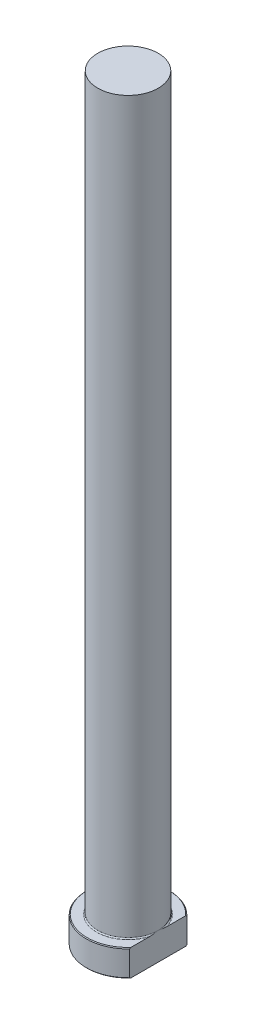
from build123d import *
from build123d.topology import SkipClean

# Parameters (mm, degrees)
CHAMFER1_SIZE = 0.2
FILLET1_R     = 0.3
KEY_DEPTH     = 201.604087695


with BuildPart() as part:
    # Sketch1 → Revolve1 (revolve)
    with BuildSketch(Plane.XY, mode=Mode.PRIVATE) as revolve1_sk:
        Polygon((0, 0), (-11, 0), (-11, 7), (-8, 7), (-8, 200), (0, 200), align=None)
    revolve(revolve1_sk.sketch.rotate(Axis((0, 259.958771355, 0), (0, -1, 0)), 270), axis=Axis((0, 259.958771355, 0), (0, -1, 0)))

    # Chamfer1
    chamfer1_edges = [part.edges().sort_by_distance(p)[0] for p in [
        (0, 7, -11),
        (0, 0, -11),
    ]]
    chamfer(chamfer1_edges, length=CHAMFER1_SIZE)

    # Fillet1
    fillet1_edges = [part.edges().sort_by_distance(p)[0] for p in [
        (0, 7, -8),
    ]]
    fillet(fillet1_edges, radius=FILLET1_R)

    # Sketch2 → KEY (cut, through all)
    with SkipClean():  # the faces are left unmerged after this step: merging them gives an invalid solid
        with BuildSketch(Plane(origin=(0, 0, 0), x_dir=(1, 0, 0), z_dir=(0, 1, 0))):
            with BuildLine():
                Line((8, 7.549834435), (8, -7.549834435))
                ThreePointArc((8, -7.549834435), (11, 0), (8, 7.549834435))
            make_face()
        extrude(amount=KEY_DEPTH, mode=Mode.SUBTRACT)


solid = part.part
